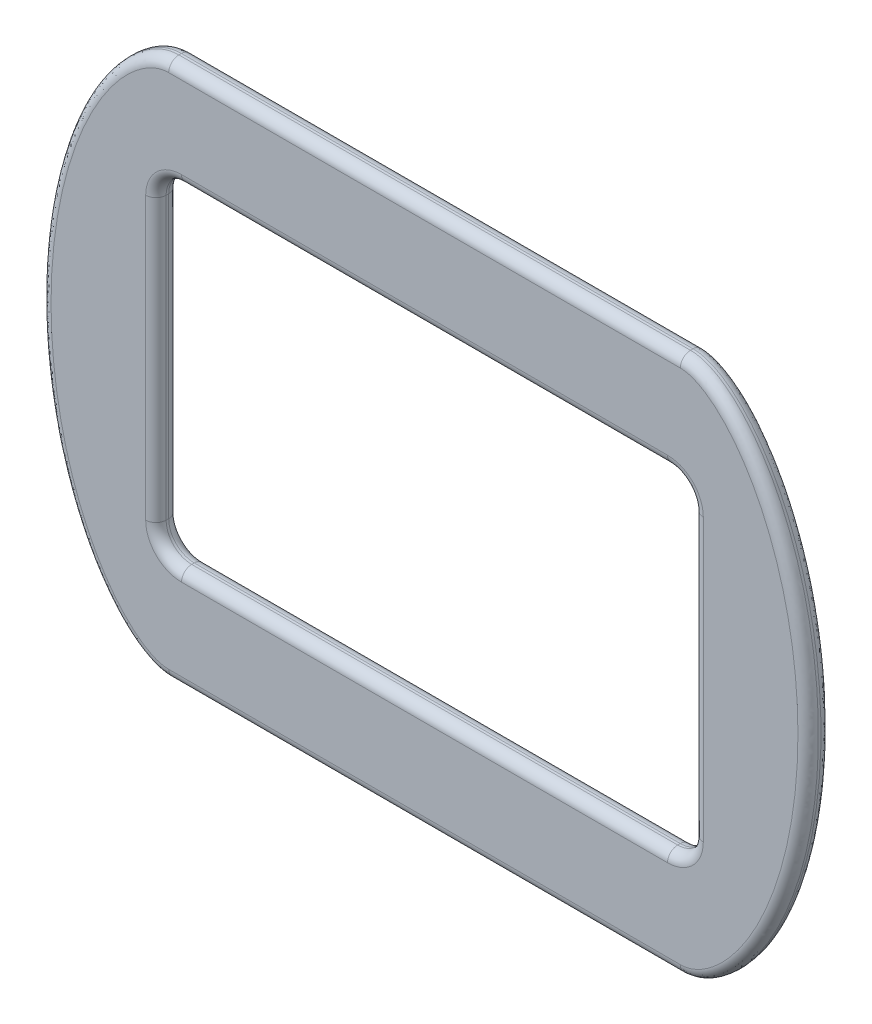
from build123d import *

# Parameters (mm, degrees)
EXTRUSION1_DEPTH = 0.9
CONG_1_R         = 0.4


with BuildPart() as part:
    # Esquisse1 → Extrusion1 (new body)
    with BuildSketch(Plane.XY):
        with BuildLine():
            Line((-10, -10.5), (10, -10.5))
            add(Edge.make_bspline(
                [(10, -10.5), (10.132603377, -10.5), (10.261991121, -10.48325444), (10.515615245, -10.422937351), (10.640958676, -10.378962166), (11.000601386, -10.220590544), (11.220823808, -10.081356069), (11.637813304, -9.76248912), (11.829603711, -9.585696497), (12.188041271, -9.210908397), (12.355020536, -9.012259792), (12.669795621, -8.597322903), (12.817568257, -8.380696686), (13.092255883, -7.940213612), (13.219931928, -7.715350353), (13.578580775, -7.029105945), (13.785428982, -6.55619192), (14.147441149, -5.585655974), (14.302525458, -5.086558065), (14.561932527, -4.086431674), (14.667236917, -3.582932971), (14.918187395, -2.063289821), (14.999919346, -1.03814598), (15.000040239, 0.516815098), (14.97919346, 1.035868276), (14.896249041, 2.062658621), (14.834179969, 2.572282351), (14.583515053, 4.089350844), (14.333154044, 5.085485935), (13.788625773, 6.548745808), (13.579976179, 7.026547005), (13.09797639, 7.948590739), (12.823797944, 8.394319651), (12.356690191, 9.010057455), (12.191243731, 9.207161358), (11.835136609, 9.58030005), (11.644745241, 9.756559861), (11.226406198, 10.077697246), (11.005199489, 10.218207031), (10.64297545, 10.378250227), (10.518820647, 10.421961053), (10.264531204, 10.48285956), (10.132745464, 10.5), (10, 10.5)],
                knots=[0, 0, 0, 0, 0.015625, 0.015625, 0.03125, 0.03125, 0.0625, 0.0625, 0.09375, 0.09375, 0.125, 0.125, 0.15625, 0.15625, 0.1875, 0.1875, 0.25, 0.25, 0.3125, 0.3125, 0.375, 0.375, 0.5, 0.5, 0.5625, 0.5625, 0.625, 0.625, 0.75, 0.75, 0.8125, 0.8125, 0.875, 0.875, 0.90625, 0.90625, 0.9375, 0.9375, 0.96875, 0.96875, 0.984375, 0.984375, 1, 1, 1, 1], degree=3))
            Line((10, 10.5), (-10, 10.5))
            add(Edge.make_bspline(
                [(-10, 10.5), (-10.132603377, 10.5), (-10.261991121, 10.48325444), (-10.515615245, 10.422937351), (-10.640958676, 10.378962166), (-11.000601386, 10.220590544), (-11.220823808, 10.081356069), (-11.637813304, 9.76248912), (-11.829603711, 9.585696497), (-12.188041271, 9.210908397), (-12.355020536, 9.012259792), (-12.669795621, 8.597322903), (-12.817568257, 8.380696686), (-13.092255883, 7.940213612), (-13.219931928, 7.715350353), (-13.578580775, 7.029105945), (-13.785428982, 6.55619192), (-14.147441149, 5.585655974), (-14.302525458, 5.086558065), (-14.561932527, 4.086431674), (-14.667236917, 3.582932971), (-14.918187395, 2.063289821), (-14.999919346, 1.03814598), (-15.000040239, -0.516815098), (-14.97919346, -1.035868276), (-14.896249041, -2.062658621), (-14.834179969, -2.572282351), (-14.583515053, -4.089350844), (-14.333154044, -5.085485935), (-13.788625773, -6.548745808), (-13.579976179, -7.026547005), (-13.09797639, -7.948590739), (-12.823797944, -8.394319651), (-12.356690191, -9.010057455), (-12.191243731, -9.207161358), (-11.835136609, -9.58030005), (-11.644745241, -9.756559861), (-11.226406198, -10.077697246), (-11.005199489, -10.218207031), (-10.64297545, -10.378250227), (-10.518820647, -10.421961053), (-10.264531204, -10.48285956), (-10.132745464, -10.5), (-10, -10.5)],
                knots=[0, 0, 0, 0, 0.015625, 0.015625, 0.03125, 0.03125, 0.0625, 0.0625, 0.09375, 0.09375, 0.125, 0.125, 0.15625, 0.15625, 0.1875, 0.1875, 0.25, 0.25, 0.3125, 0.3125, 0.375, 0.375, 0.5, 0.5, 0.5625, 0.5625, 0.625, 0.625, 0.75, 0.75, 0.8125, 0.8125, 0.875, 0.875, 0.90625, 0.90625, 0.9375, 0.9375, 0.96875, 0.96875, 0.984375, 0.984375, 1, 1, 1, 1], degree=3))
        make_face()
        with BuildLine():
            Line((-9.5, -6.5), (9.5, -6.5))
            ThreePointArc((9.5, -6.5), (10.207106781, -6.207106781), (10.5, -5.5))
            Line((10.5, -5.5), (10.5, 5.5))
            ThreePointArc((10.5, 5.5), (10.207106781, 6.207106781), (9.5, 6.5))
            Line((9.5, 6.5), (-9.5, 6.5))
            ThreePointArc((-9.5, 6.5), (-10.207106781, 6.207106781), (-10.5, 5.5))
            Line((-10.5, 5.5), (-10.5, -5.5))
            ThreePointArc((-10.5, -5.5), (-10.207106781, -6.207106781), (-9.5, -6.5))
        make_face(mode=Mode.SUBTRACT)
    extrude(amount=EXTRUSION1_DEPTH)

    # Cong_1
    cong_1_edges = [part.edges().sort_by_distance(p)[0] for p in [
        (10.5, 0, 0.9),
        (0, 10.5, 0.9),
        (-10.207106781, -6.207106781, 0),
        (0, -6.5, 0),
        (10.207106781, -6.207106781, 0),
        (10.5, 0, 0),
        (10.207106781, 6.207106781, 0),
        (0, 6.5, 0),
        (-10.207106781, 6.207106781, 0),
        (-10.5, 0, 0),
        (-10.207106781, -6.207106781, 0.9),
        (0, -6.5, 0.9),
        (10.207106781, -6.207106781, 0.9),
        (10.5, 0, 0.9),
        (10.207106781, 6.207106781, 0.9),
        (0, 6.5, 0.9),
        (-10.207106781, 6.207106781, 0.9),
        (-10.5, 0, 0.9),
        (-10.5, 0, 0.9),
        (0, 10.5, 0),
        (10.5, 0, 0),
        (0, -10.5, 0),
        (-10.5, 0, 0),
        (0, -10.5, 0.9),
    ]]
    fillet(cong_1_edges, radius=CONG_1_R)


solid = part.part
